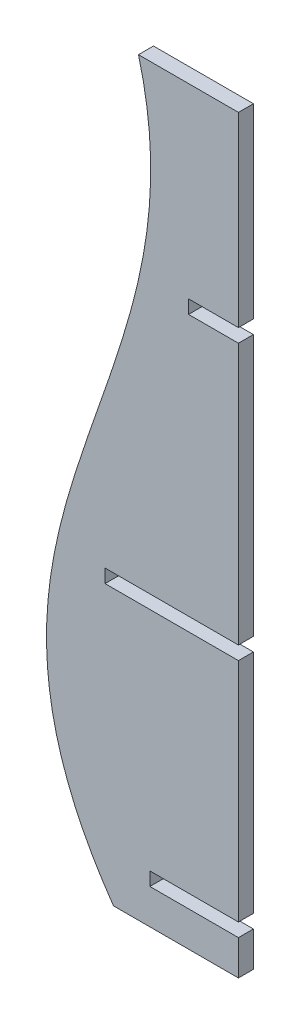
from build123d import *

# Parameters (mm, degrees)
BOSS_EXTRUDE1_DEPTH = 3


with BuildPart() as part:
    # Sketch1 → Boss-Extrude1 (new body)
    with BuildSketch(Plane.XY):
        with BuildLine():
            Line((-35, 96.234825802), (-35, 58.934825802))
            Line((-35, 58.934825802), (-44.979973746, 58.934825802))
            Line((-44.979973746, 58.934825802), (-44.979973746, 56.234825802))
            Line((-44.979973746, 56.234825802), (-35, 56.234825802))
            Line((-35, 56.234825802), (-35, 3.934825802))
            Line((-35, 3.934825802), (-61.685227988, 3.934825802))
            Line((-61.685227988, 3.934825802), (-61.685227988, 1.234825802))
            Line((-61.685227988, 1.234825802), (-35, 1.234825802))
            Line((-35, 1.234825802), (-35, -44.065174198))
            Line((-35, -44.065174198), (-52.717902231, -44.065174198))
            Line((-52.717902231, -44.065174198), (-52.717902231, -46.765174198))
            Line((-52.717902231, -46.765174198), (-35, -46.765174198))
            Line((-35, -46.765174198), (-35, -53.765174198))
            Line((-35, -53.765174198), (-60, -53.765174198))
            add(Edge.make_bspline(
                [(-55, 96.234825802), (-40.262794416, 41.234825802), (-98.511414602, 1.234825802), (-60, -53.765174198)],
                knots=[0, 0, 0, 0, 1, 1, 1, 1], degree=3))
            Line((-55, 96.234825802), (-35, 96.234825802))
        make_face()
    extrude(amount=BOSS_EXTRUDE1_DEPTH)


solid = part.part
